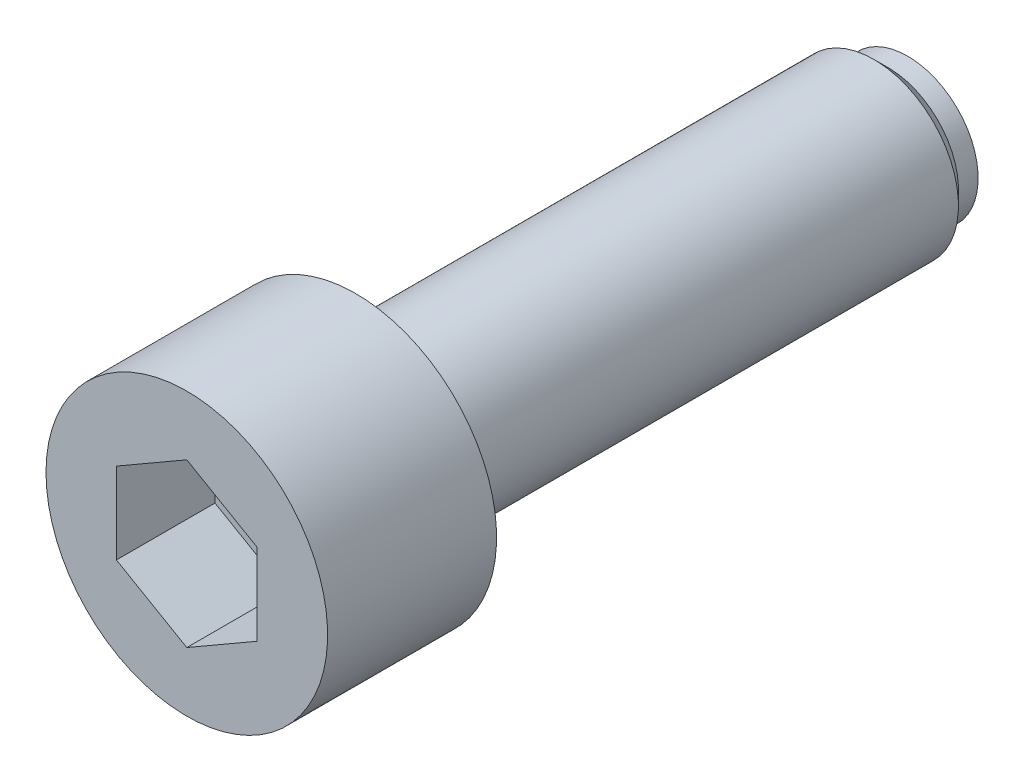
ISO-10303-21;
HEADER;
FILE_DESCRIPTION(('STEP AP214'),'2;1');
FILE_NAME('part.step','',(''),(''),'','','');
FILE_SCHEMA(('AUTOMOTIVE_DESIGN { 1 0 10303 214 1 1 1 1 }'));
ENDSEC;
DATA;
#1=APPLICATION_CONTEXT('core data for automotive mechanical design processes');
#2=APPLICATION_PROTOCOL_DEFINITION('international standard','automotive_design',2000,#1);
#3=PRODUCT_CONTEXT('',#1,'mechanical');
#4=PRODUCT('Part','Part','',(#3));
#5=PRODUCT_RELATED_PRODUCT_CATEGORY('part','',(#4));
#6=PRODUCT_DEFINITION_FORMATION('','',#4);
#7=PRODUCT_DEFINITION_CONTEXT('part definition',#1,'design');
#8=PRODUCT_DEFINITION('design','',#6,#7);
#9=PRODUCT_DEFINITION_SHAPE('','',#8);
#10=(LENGTH_UNIT() NAMED_UNIT(*) SI_UNIT(.MILLI.,.METRE.));
#11=(NAMED_UNIT(*) PLANE_ANGLE_UNIT() SI_UNIT($,.RADIAN.));
#12=(NAMED_UNIT(*) SI_UNIT($,.STERADIAN.) SOLID_ANGLE_UNIT());
#13=UNCERTAINTY_MEASURE_WITH_UNIT(LENGTH_MEASURE(1.E-05),#10,'distance_accuracy_value','');
#14=(GEOMETRIC_REPRESENTATION_CONTEXT(3) GLOBAL_UNCERTAINTY_ASSIGNED_CONTEXT((#13)) GLOBAL_UNIT_ASSIGNED_CONTEXT((#10,
#11,#12)) REPRESENTATION_CONTEXT('',''));
#15=CARTESIAN_POINT('',(0.,0.,0.));
#16=DIRECTION('',(0.,0.,1.));
#17=DIRECTION('',(1.,0.,0.));
#18=AXIS2_PLACEMENT_3D('',#15,#16,#17);
#19=CARTESIAN_POINT('',(0.,0.,0.));
#20=DIRECTION('',(0.,0.,-1.));
#21=DIRECTION('',(-1.,0.,0.));
#22=AXIS2_PLACEMENT_3D('',#19,#20,#21);
#23=PLANE('',#22);
#24=CARTESIAN_POINT('',(0.,0.,0.));
#25=DIRECTION('',(0.,0.,-1.));
#26=DIRECTION('',(-1.,0.,0.));
#27=AXIS2_PLACEMENT_3D('',#24,#25,#26);
#28=CIRCLE('',#27,1.6);
#29=CARTESIAN_POINT('',(-1.60000000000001,0.,0.));
#30=VERTEX_POINT('',#29);
#31=EDGE_CURVE('E117',#30,#30,#28,.T.);
#32=ORIENTED_EDGE('',*,*,#31,.T.);
#33=EDGE_LOOP('',(#32));
#34=FACE_BOUND('',#33,.T.);
#35=ADVANCED_FACE('F16',(#34),#23,.T.);
#36=CARTESIAN_POINT('',(-5.,0.,26.));
#37=DIRECTION('',(0.,0.,1.));
#38=DIRECTION('',(1.,0.,0.));
#39=AXIS2_PLACEMENT_3D('',#36,#37,#38);
#40=PLANE('',#39);
#41=DIRECTION('',(-0.866025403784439,0.5,0.));
#42=VECTOR('',#41,1.);
#43=CARTESIAN_POINT('',(2.5,1.44337567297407,26.));
#44=LINE('',#43,#42);
#45=CARTESIAN_POINT('',(2.5,1.44337567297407,26.));
#46=VERTEX_POINT('',#45);
#47=CARTESIAN_POINT('',(0.,2.88675134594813,26.));
#48=VERTEX_POINT('',#47);
#49=EDGE_CURVE('E30',#46,#48,#44,.T.);
#50=ORIENTED_EDGE('',*,*,#49,.F.);
#51=DIRECTION('',(0.,1.,0.));
#52=VECTOR('',#51,1.);
#53=CARTESIAN_POINT('',(2.5,-1.44337567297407,26.));
#54=LINE('',#53,#52);
#55=CARTESIAN_POINT('',(2.5,-1.44337567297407,26.));
#56=VERTEX_POINT('',#55);
#57=EDGE_CURVE('E113',#56,#46,#54,.T.);
#58=ORIENTED_EDGE('',*,*,#57,.F.);
#59=DIRECTION('',(0.866025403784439,0.5,0.));
#60=VECTOR('',#59,1.);
#61=CARTESIAN_POINT('',(0.,-2.88675134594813,26.));
#62=LINE('',#61,#60);
#63=CARTESIAN_POINT('',(0.,-2.88675134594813,26.));
#64=VERTEX_POINT('',#63);
#65=EDGE_CURVE('E111',#64,#56,#62,.T.);
#66=ORIENTED_EDGE('',*,*,#65,.F.);
#67=DIRECTION('',(0.866025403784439,-0.5,0.));
#68=VECTOR('',#67,1.);
#69=CARTESIAN_POINT('',(-2.5,-1.44337567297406,26.));
#70=LINE('',#69,#68);
#71=CARTESIAN_POINT('',(-2.5,-1.44337567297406,26.));
#72=VERTEX_POINT('',#71);
#73=EDGE_CURVE('E78',#72,#64,#70,.T.);
#74=ORIENTED_EDGE('',*,*,#73,.F.);
#75=DIRECTION('',(0.,-1.,0.));
#76=VECTOR('',#75,1.);
#77=CARTESIAN_POINT('',(-2.5,1.44337567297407,26.));
#78=LINE('',#77,#76);
#79=CARTESIAN_POINT('',(-2.5,1.44337567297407,26.));
#80=VERTEX_POINT('',#79);
#81=EDGE_CURVE('E107',#80,#72,#78,.T.);
#82=ORIENTED_EDGE('',*,*,#81,.F.);
#83=DIRECTION('',(-0.866025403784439,-0.5,0.));
#84=VECTOR('',#83,1.);
#85=CARTESIAN_POINT('',(0.,2.88675134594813,26.));
#86=LINE('',#85,#84);
#87=EDGE_CURVE('E104',#48,#80,#86,.T.);
#88=ORIENTED_EDGE('',*,*,#87,.F.);
#89=EDGE_LOOP('',(#50,#58,#66,#74,#82,#88));
#90=FACE_BOUND('',#89,.T.);
#91=CARTESIAN_POINT('',(0.,0.,26.));
#92=DIRECTION('',(0.,0.,-1.));
#93=DIRECTION('',(-1.,0.,0.));
#94=AXIS2_PLACEMENT_3D('',#91,#92,#93);
#95=CIRCLE('',#94,5.);
#96=CARTESIAN_POINT('',(-5.00000000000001,0.,26.));
#97=VERTEX_POINT('',#96);
#98=EDGE_CURVE('E10',#97,#97,#95,.T.);
#99=ORIENTED_EDGE('',*,*,#98,.F.);
#100=EDGE_LOOP('',(#99));
#101=FACE_BOUND('',#100,.T.);
#102=ADVANCED_FACE('F147',(#90,#101),#40,.T.);
#103=CARTESIAN_POINT('',(0.,0.,0.));
#104=DIRECTION('',(0.,0.,-1.));
#105=DIRECTION('',(-1.,0.,0.));
#106=AXIS2_PLACEMENT_3D('',#103,#104,#105);
#107=CYLINDRICAL_SURFACE('',#106,5.);
#108=ORIENTED_EDGE('',*,*,#98,.T.);
#109=EDGE_LOOP('',(#108));
#110=FACE_BOUND('',#109,.T.);
#111=CARTESIAN_POINT('',(0.,0.,20.));
#112=DIRECTION('',(0.,0.,-1.));
#113=DIRECTION('',(-1.,0.,0.));
#114=AXIS2_PLACEMENT_3D('',#111,#112,#113);
#115=CIRCLE('',#114,5.);
#116=CARTESIAN_POINT('',(-5.00000000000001,0.,20.));
#117=VERTEX_POINT('',#116);
#118=EDGE_CURVE('E23',#117,#117,#115,.T.);
#119=ORIENTED_EDGE('',*,*,#118,.F.);
#120=EDGE_LOOP('',(#119));
#121=FACE_BOUND('',#120,.T.);
#122=ADVANCED_FACE('F145',(#110,#121),#107,.T.);
#123=CARTESIAN_POINT('',(-3.,0.,20.));
#124=DIRECTION('',(0.,0.,-1.));
#125=DIRECTION('',(-1.,0.,0.));
#126=AXIS2_PLACEMENT_3D('',#123,#124,#125);
#127=PLANE('',#126);
#128=ORIENTED_EDGE('',*,*,#118,.T.);
#129=EDGE_LOOP('',(#128));
#130=FACE_BOUND('',#129,.T.);
#131=CARTESIAN_POINT('',(0.,0.,20.));
#132=DIRECTION('',(0.,0.,-1.));
#133=DIRECTION('',(-1.,0.,0.));
#134=AXIS2_PLACEMENT_3D('',#131,#132,#133);
#135=CIRCLE('',#134,3.);
#136=CARTESIAN_POINT('',(-3.00000000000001,0.,20.));
#137=VERTEX_POINT('',#136);
#138=EDGE_CURVE('E137',#137,#137,#135,.T.);
#139=ORIENTED_EDGE('',*,*,#138,.F.);
#140=EDGE_LOOP('',(#139));
#141=FACE_BOUND('',#140,.T.);
#142=ADVANCED_FACE('F142',(#130,#141),#127,.T.);
#143=CARTESIAN_POINT('',(0.,0.,0.));
#144=DIRECTION('',(0.,0.,-1.));
#145=DIRECTION('',(-1.,0.,0.));
#146=AXIS2_PLACEMENT_3D('',#143,#144,#145);
#147=CYLINDRICAL_SURFACE('',#146,3.);
#148=ORIENTED_EDGE('',*,*,#138,.T.);
#149=EDGE_LOOP('',(#148));
#150=FACE_BOUND('',#149,.T.);
#151=CARTESIAN_POINT('',(0.,0.,1.6));
#152=DIRECTION('',(0.,0.,-1.));
#153=DIRECTION('',(-1.,0.,0.));
#154=AXIS2_PLACEMENT_3D('',#151,#152,#153);
#155=CIRCLE('',#154,3.);
#156=CARTESIAN_POINT('',(-3.00000000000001,0.,1.6));
#157=VERTEX_POINT('',#156);
#158=EDGE_CURVE('E134',#157,#157,#155,.T.);
#159=ORIENTED_EDGE('',*,*,#158,.F.);
#160=EDGE_LOOP('',(#159));
#161=FACE_BOUND('',#160,.T.);
#162=ADVANCED_FACE('F156',(#150,#161),#147,.T.);
#163=CARTESIAN_POINT('',(0.,0.,1.1));
#164=DIRECTION('',(0.,0.,1.));
#165=DIRECTION('',(1.,0.,0.));
#166=AXIS2_PLACEMENT_3D('',#163,#164,#165);
#167=CONICAL_SURFACE('',#166,2.5,0.785398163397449);
#168=ORIENTED_EDGE('',*,*,#158,.T.);
#169=EDGE_LOOP('',(#168));
#170=FACE_BOUND('',#169,.T.);
#171=CARTESIAN_POINT('',(0.,0.,1.1));
#172=DIRECTION('',(0.,0.,-1.));
#173=DIRECTION('',(-1.,0.,0.));
#174=AXIS2_PLACEMENT_3D('',#171,#172,#173);
#175=CIRCLE('',#174,2.5);
#176=CARTESIAN_POINT('',(-2.50000000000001,0.,1.1));
#177=VERTEX_POINT('',#176);
#178=EDGE_CURVE('E131',#177,#177,#175,.T.);
#179=ORIENTED_EDGE('',*,*,#178,.F.);
#180=EDGE_LOOP('',(#179));
#181=FACE_BOUND('',#180,.T.);
#182=ADVANCED_FACE('F186',(#170,#181),#167,.T.);
#183=CARTESIAN_POINT('',(0.,0.,0.));
#184=DIRECTION('',(0.,0.,-1.));
#185=DIRECTION('',(-1.,0.,0.));
#186=AXIS2_PLACEMENT_3D('',#183,#184,#185);
#187=CYLINDRICAL_SURFACE('',#186,2.5);
#188=ORIENTED_EDGE('',*,*,#178,.T.);
#189=EDGE_LOOP('',(#188));
#190=FACE_BOUND('',#189,.T.);
#191=CARTESIAN_POINT('',(0.,0.,0.4));
#192=DIRECTION('',(0.,0.,-1.));
#193=DIRECTION('',(-1.,0.,0.));
#194=AXIS2_PLACEMENT_3D('',#191,#192,#193);
#195=CIRCLE('',#194,2.5);
#196=CARTESIAN_POINT('',(-2.50000000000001,0.,0.4));
#197=VERTEX_POINT('',#196);
#198=EDGE_CURVE('E128',#197,#197,#195,.T.);
#199=ORIENTED_EDGE('',*,*,#198,.F.);
#200=EDGE_LOOP('',(#199));
#201=FACE_BOUND('',#200,.T.);
#202=ADVANCED_FACE('F179',(#190,#201),#187,.T.);
#203=CARTESIAN_POINT('',(-1.83303027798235,0.,0.4));
#204=DIRECTION('',(0.,0.,-1.));
#205=DIRECTION('',(-1.,0.,0.));
#206=AXIS2_PLACEMENT_3D('',#203,#204,#205);
#207=PLANE('',#206);
#208=ORIENTED_EDGE('',*,*,#198,.T.);
#209=EDGE_LOOP('',(#208));
#210=FACE_BOUND('',#209,.T.);
#211=CARTESIAN_POINT('',(0.,0.,0.4));
#212=DIRECTION('',(0.,0.,-1.));
#213=DIRECTION('',(-1.,0.,0.));
#214=AXIS2_PLACEMENT_3D('',#211,#212,#213);
#215=CIRCLE('',#214,1.83303027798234);
#216=CARTESIAN_POINT('',(-1.83303027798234,0.,0.4));
#217=VERTEX_POINT('',#216);
#218=EDGE_CURVE('E125',#217,#217,#215,.T.);
#219=ORIENTED_EDGE('',*,*,#218,.F.);
#220=EDGE_LOOP('',(#219));
#221=FACE_BOUND('',#220,.T.);
#222=ADVANCED_FACE('F169',(#210,#221),#207,.T.);
#223=CARTESIAN_POINT('',(0.,0.,1.2));
#224=DIRECTION('',(0.,0.,-1.));
#225=DIRECTION('',(-1.,0.,0.));
#226=AXIS2_PLACEMENT_3D('',#223,#224,#225);
#227=SPHERICAL_SURFACE('',#226,2.);
#228=CARTESIAN_POINT('',(-1.83303027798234,0.,0.4));
#229=CARTESIAN_POINT('',(-1.83109707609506,0.,0.395570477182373));
#230=CARTESIAN_POINT('',(-1.82914781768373,0.,0.391147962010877));
#231=CARTESIAN_POINT('',(-1.82521729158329,0.,0.382317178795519));
#232=CARTESIAN_POINT('',(-1.82323602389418,0.,0.377908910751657));
#233=CARTESIAN_POINT('',(-1.81924158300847,0.,0.369106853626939));
#234=CARTESIAN_POINT('',(-1.81722840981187,0.,0.364713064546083));
#235=CARTESIAN_POINT('',(-1.81317026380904,0.,0.355940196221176));
#236=CARTESIAN_POINT('',(-1.81112529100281,0.,0.351561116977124));
#237=CARTESIAN_POINT('',(-1.80700365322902,0.,0.342817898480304));
#238=CARTESIAN_POINT('',(-1.80492698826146,0.,0.338453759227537));
#239=CARTESIAN_POINT('',(-1.80074207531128,0.,0.329740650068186));
#240=CARTESIAN_POINT('',(-1.79863382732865,0.,0.325391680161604));
#241=CARTESIAN_POINT('',(-1.79438585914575,0.,0.316709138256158));
#242=CARTESIAN_POINT('',(-1.79224613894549,0.,0.312375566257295));
#243=CARTESIAN_POINT('',(-1.7879353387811,0.,0.303724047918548));
#244=CARTESIAN_POINT('',(-1.78576425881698,0.,0.299406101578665));
#245=CARTESIAN_POINT('',(-1.78139085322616,0.,0.290786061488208));
#246=CARTESIAN_POINT('',(-1.77918852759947,0.,0.286483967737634));
#247=CARTESIAN_POINT('',(-1.77475274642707,0.,0.277895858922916));
#248=CARTESIAN_POINT('',(-1.77251929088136,0.,0.273609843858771));
#249=CARTESIAN_POINT('',(-1.76802136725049,0.,0.265054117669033));
#250=CARTESIAN_POINT('',(-1.76575689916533,0.,0.260784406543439));
#251=CARTESIAN_POINT('',(-1.761197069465,0.,0.252261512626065));
#252=CARTESIAN_POINT('',(-1.75890170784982,0.,0.248008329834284));
#253=CARTESIAN_POINT('',(-1.7542802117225,0.,0.239518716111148));
#254=CARTESIAN_POINT('',(-1.75195407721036,0.,0.235282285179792));
#255=CARTESIAN_POINT('',(-1.74727115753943,0.,0.226826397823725));
#256=CARTESIAN_POINT('',(-1.74491437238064,0.,0.222606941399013));
#257=CARTESIAN_POINT('',(-1.7401702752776,0.,0.21418522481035));
#258=CARTESIAN_POINT('',(-1.73778296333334,0.,0.2099829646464));
#259=CARTESIAN_POINT('',(-1.73297793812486,0.,0.20159586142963));
#260=CARTESIAN_POINT('',(-1.73056022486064,0.,0.19741101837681));
#261=CARTESIAN_POINT('',(-1.72569452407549,0.,0.189058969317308));
#262=CARTESIAN_POINT('',(-1.72324653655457,0.,0.184891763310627));
#263=CARTESIAN_POINT('',(-1.71832041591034,0.,0.176575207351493));
#264=CARTESIAN_POINT('',(-1.71584228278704,0.,0.172425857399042));
#265=CARTESIAN_POINT('',(-1.71085600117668,0.,0.164145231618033));
#266=CARTESIAN_POINT('',(-1.70834785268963,0.,0.160013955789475));
#267=CARTESIAN_POINT('',(-1.70330167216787,0.,0.15176969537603));
#268=CARTESIAN_POINT('',(-1.70076364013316,0.,0.147656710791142));
#269=CARTESIAN_POINT('',(-1.69565782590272,0.,0.139449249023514));
#270=CARTESIAN_POINT('',(-1.69309004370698,0.,0.135354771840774));
#271=CARTESIAN_POINT('',(-1.68792486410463,0.,0.127184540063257));
#272=CARTESIAN_POINT('',(-1.68532746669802,0.,0.123108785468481));
#273=CARTESIAN_POINT('',(-1.68010319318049,0.,0.114976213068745));
#274=CARTESIAN_POINT('',(-1.67747631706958,0.,0.110919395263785));
#275=CARTESIAN_POINT('',(-1.6721932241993,0.,0.102824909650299));
#276=CARTESIAN_POINT('',(-1.66953700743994,0.,0.0987872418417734));
#277=CARTESIAN_POINT('',(-1.66419537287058,0.,0.0907312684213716));
#278=CARTESIAN_POINT('',(-1.66150995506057,0.,0.0867129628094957));
#279=CARTESIAN_POINT('',(-1.65611005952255,0.,0.0786959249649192));
#280=CARTESIAN_POINT('',(-1.65339558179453,0.,0.0746971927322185));
#281=CARTESIAN_POINT('',(-1.64793770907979,0.,0.0667195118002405));
#282=CARTESIAN_POINT('',(-1.64519431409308,0.,0.0627405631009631));
#283=CARTESIAN_POINT('',(-1.63967875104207,0.,0.0548026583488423));
#284=CARTESIAN_POINT('',(-1.63690658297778,0.,0.0508437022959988));
#285=CARTESIAN_POINT('',(-1.63133361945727,0.,0.0429459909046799));
#286=CARTESIAN_POINT('',(-1.62853282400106,0.,0.0390072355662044));
#287=CARTESIAN_POINT('',(-1.62290275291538,0.,0.0311501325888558));
#288=CARTESIAN_POINT('',(-1.62007347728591,0.,0.0272317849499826));
#289=CARTESIAN_POINT('',(-1.61438659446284,0.,0.0194157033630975));
#290=CARTESIAN_POINT('',(-1.61152898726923,0.,0.0155179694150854));
#291=CARTESIAN_POINT('',(-1.6057855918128,0.,0.00774331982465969));
#292=CARTESIAN_POINT('',(-1.60289980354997,0.,0.00386640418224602));
#293=CARTESIAN_POINT('',(-1.60000000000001,0.,0.));
#294=B_SPLINE_CURVE_WITH_KNOTS('',3,(#228,#229,#230,#231,#232,#233,#234,#235,#236,#237,#238,
#239,#240,#241,#242,#243,#244,#245,#246,#247,#248,#249,#250,#251,#252,#253,#254,#255,#256,#257,
#258,#259,#260,#261,#262,#263,#264,#265,#266,#267,#268,#269,#270,#271,#272,#273,#274,#275,#276,
#277,#278,#279,#280,#281,#282,#283,#284,#285,#286,#287,#288,#289,#290,#291,#292,#293),
.UNSPECIFIED.,.F.,.F.,(4,2,2,2,2,2,2,2,2,2,2,2,2,2,2,2,2,2,2,2,2,2,2,2,2,2,2,2,2,2,2,2,4),(0.,
0.0144989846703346,0.0289979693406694,0.043496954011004,0.0579959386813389,0.0724949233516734,
0.0869939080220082,0.101492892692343,0.115991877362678,0.130490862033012,0.144989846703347,
0.159488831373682,0.173987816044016,0.188486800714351,0.202985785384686,0.217484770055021,
0.231983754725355,0.24648273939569,0.260981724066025,0.275480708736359,0.289979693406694,
0.304478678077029,0.318977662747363,0.333476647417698,0.347975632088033,0.362474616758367,
0.376973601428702,0.391472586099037,0.405971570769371,0.420470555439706,0.434969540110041,
0.449468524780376,0.46396750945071),.UNSPECIFIED.);
#295=EDGE_CURVE('BSEAM166',#217,#30,#294,.T.);
#296=ORIENTED_EDGE('',*,*,#218,.T.);
#297=ORIENTED_EDGE('',*,*,#31,.F.);
#298=ORIENTED_EDGE('',*,*,#295,.T.);
#299=ORIENTED_EDGE('',*,*,#295,.F.);
#300=EDGE_LOOP('',(#296,#298,#297,#299));
#301=FACE_BOUND('',#300,.T.);
#302=ADVANCED_FACE('F166',(#301),#227,.T.);
#303=CARTESIAN_POINT('',(2.5,1.44337567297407,22.5));
#304=DIRECTION('',(0.5,0.866025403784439,0.));
#305=DIRECTION('',(-0.866025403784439,0.5,0.));
#306=AXIS2_PLACEMENT_3D('',#303,#304,#305);
#307=PLANE('',#306);
#308=ORIENTED_EDGE('',*,*,#49,.T.);
#309=DIRECTION('',(0.,0.,1.));
#310=VECTOR('',#309,1.);
#311=CARTESIAN_POINT('',(0.,2.88675134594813,22.5));
#312=LINE('',#311,#310);
#313=CARTESIAN_POINT('',(0.,2.88675134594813,22.5));
#314=VERTEX_POINT('',#313);
#315=EDGE_CURVE('E60',#314,#48,#312,.T.);
#316=ORIENTED_EDGE('',*,*,#315,.F.);
#317=DIRECTION('',(-0.866025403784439,0.5,0.));
#318=VECTOR('',#317,1.);
#319=CARTESIAN_POINT('',(2.5,1.44337567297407,22.5));
#320=LINE('',#319,#318);
#321=CARTESIAN_POINT('',(2.5,1.44337567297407,22.5));
#322=VERTEX_POINT('',#321);
#323=EDGE_CURVE('E115',#322,#314,#320,.T.);
#324=ORIENTED_EDGE('',*,*,#323,.F.);
#325=DIRECTION('',(0.,0.,1.));
#326=VECTOR('',#325,1.);
#327=CARTESIAN_POINT('',(2.5,1.44337567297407,22.5));
#328=LINE('',#327,#326);
#329=EDGE_CURVE('E38',#322,#46,#328,.T.);
#330=ORIENTED_EDGE('',*,*,#329,.T.);
#331=EDGE_LOOP('',(#308,#316,#324,#330));
#332=FACE_BOUND('',#331,.T.);
#333=ADVANCED_FACE('F168',(#332),#307,.F.);
#334=CARTESIAN_POINT('',(2.5,-1.44337567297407,22.5));
#335=DIRECTION('',(1.,0.,0.));
#336=DIRECTION('',(0.,0.,-1.));
#337=AXIS2_PLACEMENT_3D('',#334,#335,#336);
#338=PLANE('',#337);
#339=ORIENTED_EDGE('',*,*,#57,.T.);
#340=ORIENTED_EDGE('',*,*,#329,.F.);
#341=DIRECTION('',(0.,1.,0.));
#342=VECTOR('',#341,1.);
#343=CARTESIAN_POINT('',(2.5,-1.44337567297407,22.5));
#344=LINE('',#343,#342);
#345=CARTESIAN_POINT('',(2.5,-1.44337567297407,22.5));
#346=VERTEX_POINT('',#345);
#347=EDGE_CURVE('E90',#346,#322,#344,.T.);
#348=ORIENTED_EDGE('',*,*,#347,.F.);
#349=DIRECTION('',(0.,0.,1.));
#350=VECTOR('',#349,1.);
#351=CARTESIAN_POINT('',(2.5,-1.44337567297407,22.5));
#352=LINE('',#351,#350);
#353=EDGE_CURVE('E82',#346,#56,#352,.T.);
#354=ORIENTED_EDGE('',*,*,#353,.T.);
#355=EDGE_LOOP('',(#339,#340,#348,#354));
#356=FACE_BOUND('',#355,.T.);
#357=ADVANCED_FACE('F177',(#356),#338,.F.);
#358=CARTESIAN_POINT('',(0.,-2.88675134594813,22.5));
#359=DIRECTION('',(0.5,-0.866025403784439,0.));
#360=DIRECTION('',(0.866025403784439,0.5,0.));
#361=AXIS2_PLACEMENT_3D('',#358,#359,#360);
#362=PLANE('',#361);
#363=ORIENTED_EDGE('',*,*,#65,.T.);
#364=ORIENTED_EDGE('',*,*,#353,.F.);
#365=DIRECTION('',(0.866025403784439,0.5,0.));
#366=VECTOR('',#365,1.);
#367=CARTESIAN_POINT('',(0.,-2.88675134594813,22.5));
#368=LINE('',#367,#366);
#369=CARTESIAN_POINT('',(0.,-2.88675134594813,22.5));
#370=VERTEX_POINT('',#369);
#371=EDGE_CURVE('E86',#370,#346,#368,.T.);
#372=ORIENTED_EDGE('',*,*,#371,.F.);
#373=DIRECTION('',(0.,0.,1.));
#374=VECTOR('',#373,1.);
#375=CARTESIAN_POINT('',(0.,-2.88675134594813,22.5));
#376=LINE('',#375,#374);
#377=EDGE_CURVE('E71',#370,#64,#376,.T.);
#378=ORIENTED_EDGE('',*,*,#377,.T.);
#379=EDGE_LOOP('',(#363,#364,#372,#378));
#380=FACE_BOUND('',#379,.T.);
#381=ADVANCED_FACE('F87',(#380),#362,.F.);
#382=CARTESIAN_POINT('',(-2.5,-1.44337567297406,22.5));
#383=DIRECTION('',(-0.5,-0.866025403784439,0.));
#384=DIRECTION('',(0.866025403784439,-0.5,0.));
#385=AXIS2_PLACEMENT_3D('',#382,#383,#384);
#386=PLANE('',#385);
#387=ORIENTED_EDGE('',*,*,#73,.T.);
#388=ORIENTED_EDGE('',*,*,#377,.F.);
#389=DIRECTION('',(0.866025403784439,-0.5,0.));
#390=VECTOR('',#389,1.);
#391=CARTESIAN_POINT('',(-2.5,-1.44337567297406,22.5));
#392=LINE('',#391,#390);
#393=CARTESIAN_POINT('',(-2.5,-1.44337567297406,22.5));
#394=VERTEX_POINT('',#393);
#395=EDGE_CURVE('E75',#394,#370,#392,.T.);
#396=ORIENTED_EDGE('',*,*,#395,.F.);
#397=DIRECTION('',(0.,0.,1.));
#398=VECTOR('',#397,1.);
#399=CARTESIAN_POINT('',(-2.5,-1.44337567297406,22.5));
#400=LINE('',#399,#398);
#401=EDGE_CURVE('E83',#394,#72,#400,.T.);
#402=ORIENTED_EDGE('',*,*,#401,.T.);
#403=EDGE_LOOP('',(#387,#388,#396,#402));
#404=FACE_BOUND('',#403,.T.);
#405=ADVANCED_FACE('F73',(#404),#386,.F.);
#406=CARTESIAN_POINT('',(-2.5,1.44337567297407,22.5));
#407=DIRECTION('',(-1.,0.,0.));
#408=DIRECTION('',(0.,0.,1.));
#409=AXIS2_PLACEMENT_3D('',#406,#407,#408);
#410=PLANE('',#409);
#411=ORIENTED_EDGE('',*,*,#81,.T.);
#412=ORIENTED_EDGE('',*,*,#401,.F.);
#413=DIRECTION('',(0.,-1.,0.));
#414=VECTOR('',#413,1.);
#415=CARTESIAN_POINT('',(-2.5,1.44337567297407,22.5));
#416=LINE('',#415,#414);
#417=CARTESIAN_POINT('',(-2.5,1.44337567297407,22.5));
#418=VERTEX_POINT('',#417);
#419=EDGE_CURVE('E96',#418,#394,#416,.T.);
#420=ORIENTED_EDGE('',*,*,#419,.F.);
#421=DIRECTION('',(0.,0.,1.));
#422=VECTOR('',#421,1.);
#423=CARTESIAN_POINT('',(-2.5,1.44337567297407,22.5));
#424=LINE('',#423,#422);
#425=EDGE_CURVE('E120',#418,#80,#424,.T.);
#426=ORIENTED_EDGE('',*,*,#425,.T.);
#427=EDGE_LOOP('',(#411,#412,#420,#426));
#428=FACE_BOUND('',#427,.T.);
#429=ADVANCED_FACE('F279',(#428),#410,.F.);
#430=CARTESIAN_POINT('',(0.,2.88675134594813,22.5));
#431=DIRECTION('',(-0.5,0.866025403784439,0.));
#432=DIRECTION('',(-0.866025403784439,-0.5,0.));
#433=AXIS2_PLACEMENT_3D('',#430,#431,#432);
#434=PLANE('',#433);
#435=ORIENTED_EDGE('',*,*,#87,.T.);
#436=ORIENTED_EDGE('',*,*,#425,.F.);
#437=DIRECTION('',(-0.866025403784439,-0.5,0.));
#438=VECTOR('',#437,1.);
#439=CARTESIAN_POINT('',(0.,2.88675134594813,22.5));
#440=LINE('',#439,#438);
#441=EDGE_CURVE('E98',#314,#418,#440,.T.);
#442=ORIENTED_EDGE('',*,*,#441,.F.);
#443=ORIENTED_EDGE('',*,*,#315,.T.);
#444=EDGE_LOOP('',(#435,#436,#442,#443));
#445=FACE_BOUND('',#444,.T.);
#446=ADVANCED_FACE('F287',(#445),#434,.F.);
#447=CARTESIAN_POINT('',(0.,0.,22.5));
#448=DIRECTION('',(0.,0.,1.));
#449=DIRECTION('',(1.,0.,0.));
#450=AXIS2_PLACEMENT_3D('',#447,#448,#449);
#451=PLANE('',#450);
#452=ORIENTED_EDGE('',*,*,#323,.T.);
#453=ORIENTED_EDGE('',*,*,#441,.T.);
#454=ORIENTED_EDGE('',*,*,#419,.T.);
#455=ORIENTED_EDGE('',*,*,#395,.T.);
#456=ORIENTED_EDGE('',*,*,#371,.T.);
#457=ORIENTED_EDGE('',*,*,#347,.T.);
#458=EDGE_LOOP('',(#452,#453,#454,#455,#456,#457));
#459=FACE_BOUND('',#458,.T.);
#460=ADVANCED_FACE('F93',(#459),#451,.T.);
#461=CLOSED_SHELL('',(#35,#102,#122,#142,#162,#182,#202,#222,#302,#333,#357,#381,#405,#429,#446,#460));
#462=MANIFOLD_SOLID_BREP('B1',#461);
#463=ADVANCED_BREP_SHAPE_REPRESENTATION('',(#18,#462),#14);
#464=SHAPE_DEFINITION_REPRESENTATION(#9,#463);
ENDSEC;
END-ISO-10303-21;
